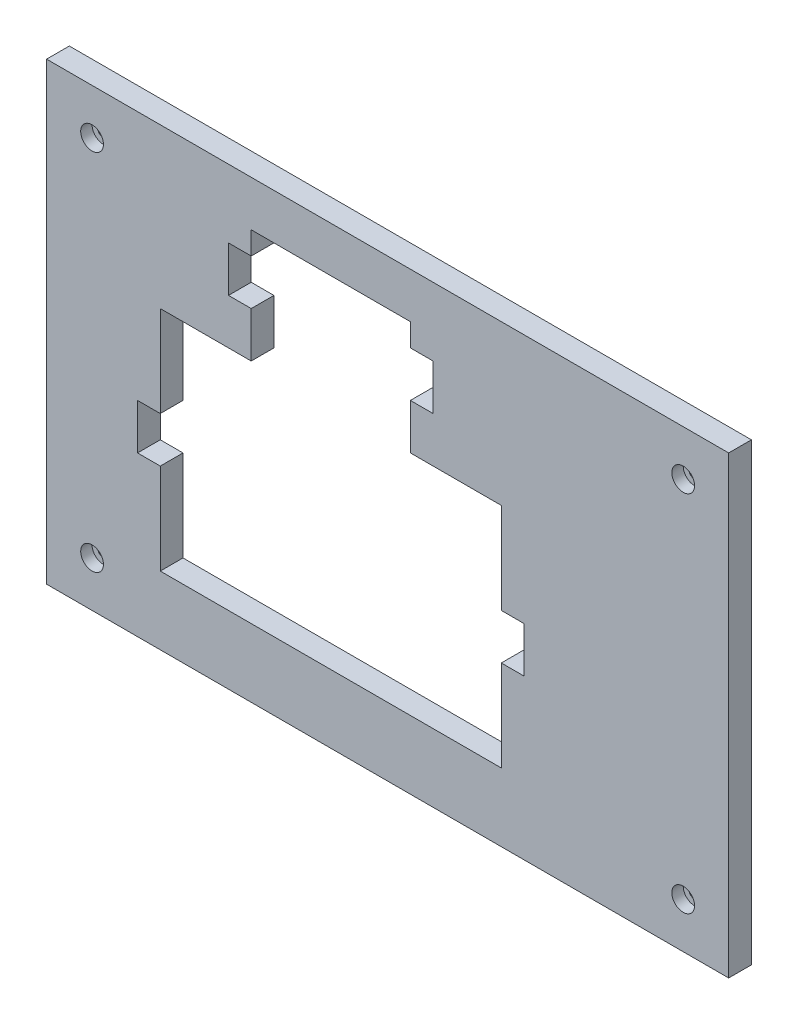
ISO-10303-21;
HEADER;
FILE_DESCRIPTION(('STEP AP214'),'2;1');
FILE_NAME('part.step','',(''),(''),'','','');
FILE_SCHEMA(('AUTOMOTIVE_DESIGN { 1 0 10303 214 1 1 1 1 }'));
ENDSEC;
DATA;
#1=APPLICATION_CONTEXT('core data for automotive mechanical design processes');
#2=APPLICATION_PROTOCOL_DEFINITION('international standard','automotive_design',2000,#1);
#3=PRODUCT_CONTEXT('',#1,'mechanical');
#4=PRODUCT('Part','Part','',(#3));
#5=PRODUCT_RELATED_PRODUCT_CATEGORY('part','',(#4));
#6=PRODUCT_DEFINITION_FORMATION('','',#4);
#7=PRODUCT_DEFINITION_CONTEXT('part definition',#1,'design');
#8=PRODUCT_DEFINITION('design','',#6,#7);
#9=PRODUCT_DEFINITION_SHAPE('','',#8);
#10=(LENGTH_UNIT() NAMED_UNIT(*) SI_UNIT(.MILLI.,.METRE.));
#11=(NAMED_UNIT(*) PLANE_ANGLE_UNIT() SI_UNIT($,.RADIAN.));
#12=(NAMED_UNIT(*) SI_UNIT($,.STERADIAN.) SOLID_ANGLE_UNIT());
#13=UNCERTAINTY_MEASURE_WITH_UNIT(LENGTH_MEASURE(1.E-05),#10,'distance_accuracy_value','');
#14=(GEOMETRIC_REPRESENTATION_CONTEXT(3) GLOBAL_UNCERTAINTY_ASSIGNED_CONTEXT((#13)) GLOBAL_UNIT_ASSIGNED_CONTEXT((#10,
#11,#12)) REPRESENTATION_CONTEXT('',''));
#15=CARTESIAN_POINT('',(0.,0.,0.));
#16=DIRECTION('',(0.,0.,1.));
#17=DIRECTION('',(1.,0.,0.));
#18=AXIS2_PLACEMENT_3D('',#15,#16,#17);
#19=CARTESIAN_POINT('',(0.,0.,-10.));
#20=DIRECTION('',(-1.,0.,0.));
#21=DIRECTION('',(0.,0.,1.));
#22=AXIS2_PLACEMENT_3D('',#19,#20,#21);
#23=PLANE('',#22);
#24=DIRECTION('',(0.,-1.,0.));
#25=VECTOR('',#24,1.);
#26=CARTESIAN_POINT('',(0.,0.,0.));
#27=LINE('',#26,#25);
#28=CARTESIAN_POINT('',(0.,200.,0.));
#29=VERTEX_POINT('',#28);
#30=CARTESIAN_POINT('',(0.,0.,0.));
#31=VERTEX_POINT('',#30);
#32=EDGE_CURVE('E366',#29,#31,#27,.T.);
#33=ORIENTED_EDGE('',*,*,#32,.F.);
#34=DIRECTION('',(0.,0.,1.));
#35=VECTOR('',#34,1.);
#36=CARTESIAN_POINT('',(0.,200.,-10.));
#37=LINE('',#36,#35);
#38=CARTESIAN_POINT('',(0.,200.,-10.));
#39=VERTEX_POINT('',#38);
#40=EDGE_CURVE('E11',#39,#29,#37,.T.);
#41=ORIENTED_EDGE('',*,*,#40,.F.);
#42=DIRECTION('',(0.,-1.,0.));
#43=VECTOR('',#42,1.);
#44=CARTESIAN_POINT('',(0.,0.,-10.));
#45=LINE('',#44,#43);
#46=CARTESIAN_POINT('',(0.,0.,-10.));
#47=VERTEX_POINT('',#46);
#48=EDGE_CURVE('E420',#39,#47,#45,.T.);
#49=ORIENTED_EDGE('',*,*,#48,.T.);
#50=DIRECTION('',(0.,0.,1.));
#51=VECTOR('',#50,1.);
#52=CARTESIAN_POINT('',(0.,0.,-10.));
#53=LINE('',#52,#51);
#54=EDGE_CURVE('E29',#47,#31,#53,.T.);
#55=ORIENTED_EDGE('',*,*,#54,.T.);
#56=EDGE_LOOP('',(#33,#41,#49,#55));
#57=FACE_BOUND('',#56,.T.);
#58=ADVANCED_FACE('F26',(#57),#23,.T.);
#59=CARTESIAN_POINT('',(0.,200.,-10.));
#60=DIRECTION('',(0.,1.,0.));
#61=DIRECTION('',(0.,0.,1.));
#62=AXIS2_PLACEMENT_3D('',#59,#60,#61);
#63=PLANE('',#62);
#64=DIRECTION('',(-1.,0.,0.));
#65=VECTOR('',#64,1.);
#66=CARTESIAN_POINT('',(0.,200.,0.));
#67=LINE('',#66,#65);
#68=CARTESIAN_POINT('',(300.,200.,0.));
#69=VERTEX_POINT('',#68);
#70=EDGE_CURVE('E417',#69,#29,#67,.T.);
#71=ORIENTED_EDGE('',*,*,#70,.F.);
#72=DIRECTION('',(0.,0.,1.));
#73=VECTOR('',#72,1.);
#74=CARTESIAN_POINT('',(300.,200.,-10.));
#75=LINE('',#74,#73);
#76=CARTESIAN_POINT('',(300.,200.,-10.));
#77=VERTEX_POINT('',#76);
#78=EDGE_CURVE('E34',#77,#69,#75,.T.);
#79=ORIENTED_EDGE('',*,*,#78,.F.);
#80=DIRECTION('',(-1.,0.,0.));
#81=VECTOR('',#80,1.);
#82=CARTESIAN_POINT('',(0.,200.,-10.));
#83=LINE('',#82,#81);
#84=EDGE_CURVE('E429',#77,#39,#83,.T.);
#85=ORIENTED_EDGE('',*,*,#84,.T.);
#86=ORIENTED_EDGE('',*,*,#40,.T.);
#87=EDGE_LOOP('',(#71,#79,#85,#86));
#88=FACE_BOUND('',#87,.T.);
#89=ADVANCED_FACE('F443',(#88),#63,.T.);
#90=CARTESIAN_POINT('',(300.,0.,-10.));
#91=DIRECTION('',(1.,0.,0.));
#92=DIRECTION('',(0.,0.,-1.));
#93=AXIS2_PLACEMENT_3D('',#90,#91,#92);
#94=PLANE('',#93);
#95=DIRECTION('',(0.,1.,0.));
#96=VECTOR('',#95,1.);
#97=CARTESIAN_POINT('',(300.,0.,0.));
#98=LINE('',#97,#96);
#99=CARTESIAN_POINT('',(300.,0.,0.));
#100=VERTEX_POINT('',#99);
#101=EDGE_CURVE('E414',#100,#69,#98,.T.);
#102=ORIENTED_EDGE('',*,*,#101,.F.);
#103=DIRECTION('',(0.,0.,1.));
#104=VECTOR('',#103,1.);
#105=CARTESIAN_POINT('',(300.,0.,-10.));
#106=LINE('',#105,#104);
#107=CARTESIAN_POINT('',(300.,0.,-10.));
#108=VERTEX_POINT('',#107);
#109=EDGE_CURVE('E432',#108,#100,#106,.T.);
#110=ORIENTED_EDGE('',*,*,#109,.F.);
#111=DIRECTION('',(0.,1.,0.));
#112=VECTOR('',#111,1.);
#113=CARTESIAN_POINT('',(300.,0.,-10.));
#114=LINE('',#113,#112);
#115=EDGE_CURVE('E426',#108,#77,#114,.T.);
#116=ORIENTED_EDGE('',*,*,#115,.T.);
#117=ORIENTED_EDGE('',*,*,#78,.T.);
#118=EDGE_LOOP('',(#102,#110,#116,#117));
#119=FACE_BOUND('',#118,.T.);
#120=ADVANCED_FACE('F449',(#119),#94,.T.);
#121=CARTESIAN_POINT('',(0.,0.,-10.));
#122=DIRECTION('',(0.,-1.,0.));
#123=DIRECTION('',(0.,0.,-1.));
#124=AXIS2_PLACEMENT_3D('',#121,#122,#123);
#125=PLANE('',#124);
#126=DIRECTION('',(1.,0.,0.));
#127=VECTOR('',#126,1.);
#128=CARTESIAN_POINT('',(0.,0.,0.));
#129=LINE('',#128,#127);
#130=EDGE_CURVE('E411',#31,#100,#129,.T.);
#131=ORIENTED_EDGE('',*,*,#130,.F.);
#132=ORIENTED_EDGE('',*,*,#54,.F.);
#133=DIRECTION('',(1.,0.,0.));
#134=VECTOR('',#133,1.);
#135=CARTESIAN_POINT('',(0.,0.,-10.));
#136=LINE('',#135,#134);
#137=EDGE_CURVE('E423',#47,#108,#136,.T.);
#138=ORIENTED_EDGE('',*,*,#137,.T.);
#139=ORIENTED_EDGE('',*,*,#109,.T.);
#140=EDGE_LOOP('',(#131,#132,#138,#139));
#141=FACE_BOUND('',#140,.T.);
#142=ADVANCED_FACE('F440',(#141),#125,.T.);
#143=CARTESIAN_POINT('',(0.,200.,-10.));
#144=DIRECTION('',(0.,0.,-1.));
#145=DIRECTION('',(-1.,0.,0.));
#146=AXIS2_PLACEMENT_3D('',#143,#144,#145);
#147=PLANE('',#146);
#148=CARTESIAN_POINT('',(280.,20.,-10.));
#149=DIRECTION('',(0.,0.,1.));
#150=DIRECTION('',(1.,0.,0.));
#151=AXIS2_PLACEMENT_3D('',#148,#149,#150);
#152=CIRCLE('',#151,2.5);
#153=CARTESIAN_POINT('',(282.5,20.,-10.));
#154=VERTEX_POINT('',#153);
#155=EDGE_CURVE('E772',#154,#154,#152,.T.);
#156=ORIENTED_EDGE('',*,*,#155,.T.);
#157=EDGE_LOOP('',(#156));
#158=FACE_BOUND('',#157,.T.);
#159=CARTESIAN_POINT('',(280.,180.,-10.));
#160=DIRECTION('',(0.,0.,1.));
#161=DIRECTION('',(1.,0.,0.));
#162=AXIS2_PLACEMENT_3D('',#159,#160,#161);
#163=CIRCLE('',#162,2.5);
#164=CARTESIAN_POINT('',(282.5,180.,-10.));
#165=VERTEX_POINT('',#164);
#166=EDGE_CURVE('E782',#165,#165,#163,.T.);
#167=ORIENTED_EDGE('',*,*,#166,.T.);
#168=EDGE_LOOP('',(#167));
#169=FACE_BOUND('',#168,.T.);
#170=CARTESIAN_POINT('',(20.,20.,-10.));
#171=DIRECTION('',(0.,0.,1.));
#172=DIRECTION('',(1.,0.,0.));
#173=AXIS2_PLACEMENT_3D('',#170,#171,#172);
#174=CIRCLE('',#173,2.5);
#175=CARTESIAN_POINT('',(22.5,20.,-10.));
#176=VERTEX_POINT('',#175);
#177=EDGE_CURVE('E788',#176,#176,#174,.T.);
#178=ORIENTED_EDGE('',*,*,#177,.T.);
#179=EDGE_LOOP('',(#178));
#180=FACE_BOUND('',#179,.T.);
#181=CARTESIAN_POINT('',(20.,180.,-10.));
#182=DIRECTION('',(0.,0.,1.));
#183=DIRECTION('',(1.,0.,0.));
#184=AXIS2_PLACEMENT_3D('',#181,#182,#183);
#185=CIRCLE('',#184,2.5);
#186=CARTESIAN_POINT('',(22.5,180.,-10.));
#187=VERTEX_POINT('',#186);
#188=EDGE_CURVE('E812',#187,#187,#185,.T.);
#189=ORIENTED_EDGE('',*,*,#188,.T.);
#190=EDGE_LOOP('',(#189));
#191=FACE_BOUND('',#190,.T.);
#192=DIRECTION('',(0.,1.,0.));
#193=VECTOR('',#192,1.);
#194=CARTESIAN_POINT('',(200.,30.,-10.));
#195=LINE('',#194,#193);
#196=CARTESIAN_POINT('',(200.,30.,-10.));
#197=VERTEX_POINT('',#196);
#198=CARTESIAN_POINT('',(200.,70.,-10.));
#199=VERTEX_POINT('',#198);
#200=EDGE_CURVE('E295',#197,#199,#195,.T.);
#201=ORIENTED_EDGE('',*,*,#200,.T.);
#202=DIRECTION('',(1.,0.,0.));
#203=VECTOR('',#202,1.);
#204=CARTESIAN_POINT('',(200.,70.,-10.));
#205=LINE('',#204,#203);
#206=CARTESIAN_POINT('',(210.,70.,-10.));
#207=VERTEX_POINT('',#206);
#208=EDGE_CURVE('E298',#199,#207,#205,.T.);
#209=ORIENTED_EDGE('',*,*,#208,.T.);
#210=DIRECTION('',(0.,1.,0.));
#211=VECTOR('',#210,1.);
#212=CARTESIAN_POINT('',(210.,70.,-10.));
#213=LINE('',#212,#211);
#214=CARTESIAN_POINT('',(210.,90.,-10.));
#215=VERTEX_POINT('',#214);
#216=EDGE_CURVE('E42',#207,#215,#213,.T.);
#217=ORIENTED_EDGE('',*,*,#216,.T.);
#218=DIRECTION('',(-1.,0.,0.));
#219=VECTOR('',#218,1.);
#220=CARTESIAN_POINT('',(210.,90.,-10.));
#221=LINE('',#220,#219);
#222=CARTESIAN_POINT('',(200.,90.,-10.));
#223=VERTEX_POINT('',#222);
#224=EDGE_CURVE('E301',#215,#223,#221,.T.);
#225=ORIENTED_EDGE('',*,*,#224,.T.);
#226=DIRECTION('',(0.,1.,0.));
#227=VECTOR('',#226,1.);
#228=CARTESIAN_POINT('',(200.,90.,-10.));
#229=LINE('',#228,#227);
#230=CARTESIAN_POINT('',(200.,130.,-10.));
#231=VERTEX_POINT('',#230);
#232=EDGE_CURVE('E304',#223,#231,#229,.T.);
#233=ORIENTED_EDGE('',*,*,#232,.T.);
#234=DIRECTION('',(-1.,0.,0.));
#235=VECTOR('',#234,1.);
#236=CARTESIAN_POINT('',(200.,130.,-10.));
#237=LINE('',#236,#235);
#238=CARTESIAN_POINT('',(160.,130.,-10.));
#239=VERTEX_POINT('',#238);
#240=EDGE_CURVE('E307',#231,#239,#237,.T.);
#241=ORIENTED_EDGE('',*,*,#240,.T.);
#242=DIRECTION('',(0.,1.,0.));
#243=VECTOR('',#242,1.);
#244=CARTESIAN_POINT('',(160.,130.,-10.));
#245=LINE('',#244,#243);
#246=CARTESIAN_POINT('',(160.,150.,-10.));
#247=VERTEX_POINT('',#246);
#248=EDGE_CURVE('E310',#239,#247,#245,.T.);
#249=ORIENTED_EDGE('',*,*,#248,.T.);
#250=DIRECTION('',(1.,0.,0.));
#251=VECTOR('',#250,1.);
#252=CARTESIAN_POINT('',(160.,150.,-10.));
#253=LINE('',#252,#251);
#254=CARTESIAN_POINT('',(170.,150.,-10.));
#255=VERTEX_POINT('',#254);
#256=EDGE_CURVE('E313',#247,#255,#253,.T.);
#257=ORIENTED_EDGE('',*,*,#256,.T.);
#258=DIRECTION('',(0.,1.,0.));
#259=VECTOR('',#258,1.);
#260=CARTESIAN_POINT('',(170.,150.,-10.));
#261=LINE('',#260,#259);
#262=CARTESIAN_POINT('',(170.,170.,-10.));
#263=VERTEX_POINT('',#262);
#264=EDGE_CURVE('E316',#255,#263,#261,.T.);
#265=ORIENTED_EDGE('',*,*,#264,.T.);
#266=DIRECTION('',(-1.,0.,0.));
#267=VECTOR('',#266,1.);
#268=CARTESIAN_POINT('',(170.,170.,-10.));
#269=LINE('',#268,#267);
#270=CARTESIAN_POINT('',(160.,170.,-10.));
#271=VERTEX_POINT('',#270);
#272=EDGE_CURVE('E319',#263,#271,#269,.T.);
#273=ORIENTED_EDGE('',*,*,#272,.T.);
#274=DIRECTION('',(0.,1.,0.));
#275=VECTOR('',#274,1.);
#276=CARTESIAN_POINT('',(160.,170.,-10.));
#277=LINE('',#276,#275);
#278=CARTESIAN_POINT('',(160.,180.,-10.));
#279=VERTEX_POINT('',#278);
#280=EDGE_CURVE('E322',#271,#279,#277,.T.);
#281=ORIENTED_EDGE('',*,*,#280,.T.);
#282=DIRECTION('',(-1.,0.,0.));
#283=VECTOR('',#282,1.);
#284=CARTESIAN_POINT('',(160.,180.,-10.));
#285=LINE('',#284,#283);
#286=CARTESIAN_POINT('',(90.,180.,-10.));
#287=VERTEX_POINT('',#286);
#288=EDGE_CURVE('E325',#279,#287,#285,.T.);
#289=ORIENTED_EDGE('',*,*,#288,.T.);
#290=DIRECTION('',(0.,-1.,0.));
#291=VECTOR('',#290,1.);
#292=CARTESIAN_POINT('',(90.,170.,-10.));
#293=LINE('',#292,#291);
#294=CARTESIAN_POINT('',(90.,170.,-10.));
#295=VERTEX_POINT('',#294);
#296=EDGE_CURVE('E328',#287,#295,#293,.T.);
#297=ORIENTED_EDGE('',*,*,#296,.T.);
#298=DIRECTION('',(-1.,0.,0.));
#299=VECTOR('',#298,1.);
#300=CARTESIAN_POINT('',(80.,170.,-10.));
#301=LINE('',#300,#299);
#302=CARTESIAN_POINT('',(80.,170.,-10.));
#303=VERTEX_POINT('',#302);
#304=EDGE_CURVE('E331',#295,#303,#301,.T.);
#305=ORIENTED_EDGE('',*,*,#304,.T.);
#306=DIRECTION('',(0.,-1.,0.));
#307=VECTOR('',#306,1.);
#308=CARTESIAN_POINT('',(80.,150.,-10.));
#309=LINE('',#308,#307);
#310=CARTESIAN_POINT('',(80.,150.,-10.));
#311=VERTEX_POINT('',#310);
#312=EDGE_CURVE('E334',#303,#311,#309,.T.);
#313=ORIENTED_EDGE('',*,*,#312,.T.);
#314=DIRECTION('',(1.,0.,0.));
#315=VECTOR('',#314,1.);
#316=CARTESIAN_POINT('',(90.,150.,-10.));
#317=LINE('',#316,#315);
#318=CARTESIAN_POINT('',(90.,150.,-10.));
#319=VERTEX_POINT('',#318);
#320=EDGE_CURVE('E337',#311,#319,#317,.T.);
#321=ORIENTED_EDGE('',*,*,#320,.T.);
#322=DIRECTION('',(0.,-1.,0.));
#323=VECTOR('',#322,1.);
#324=CARTESIAN_POINT('',(90.,130.,-10.));
#325=LINE('',#324,#323);
#326=CARTESIAN_POINT('',(90.,130.,-10.));
#327=VERTEX_POINT('',#326);
#328=EDGE_CURVE('E340',#319,#327,#325,.T.);
#329=ORIENTED_EDGE('',*,*,#328,.T.);
#330=DIRECTION('',(-1.,0.,0.));
#331=VECTOR('',#330,1.);
#332=CARTESIAN_POINT('',(50.,130.,-10.));
#333=LINE('',#332,#331);
#334=CARTESIAN_POINT('',(50.,130.,-10.));
#335=VERTEX_POINT('',#334);
#336=EDGE_CURVE('E343',#327,#335,#333,.T.);
#337=ORIENTED_EDGE('',*,*,#336,.T.);
#338=DIRECTION('',(0.,-1.,0.));
#339=VECTOR('',#338,1.);
#340=CARTESIAN_POINT('',(50.,90.,-10.));
#341=LINE('',#340,#339);
#342=CARTESIAN_POINT('',(50.,90.,-10.));
#343=VERTEX_POINT('',#342);
#344=EDGE_CURVE('E346',#335,#343,#341,.T.);
#345=ORIENTED_EDGE('',*,*,#344,.T.);
#346=DIRECTION('',(-1.,0.,0.));
#347=VECTOR('',#346,1.);
#348=CARTESIAN_POINT('',(40.,90.,-10.));
#349=LINE('',#348,#347);
#350=CARTESIAN_POINT('',(40.,90.,-10.));
#351=VERTEX_POINT('',#350);
#352=EDGE_CURVE('E349',#343,#351,#349,.T.);
#353=ORIENTED_EDGE('',*,*,#352,.T.);
#354=DIRECTION('',(0.,-1.,0.));
#355=VECTOR('',#354,1.);
#356=CARTESIAN_POINT('',(40.,70.,-10.));
#357=LINE('',#356,#355);
#358=CARTESIAN_POINT('',(40.,70.,-10.));
#359=VERTEX_POINT('',#358);
#360=EDGE_CURVE('E352',#351,#359,#357,.T.);
#361=ORIENTED_EDGE('',*,*,#360,.T.);
#362=DIRECTION('',(1.,0.,0.));
#363=VECTOR('',#362,1.);
#364=CARTESIAN_POINT('',(50.,70.,-10.));
#365=LINE('',#364,#363);
#366=CARTESIAN_POINT('',(50.,70.,-10.));
#367=VERTEX_POINT('',#366);
#368=EDGE_CURVE('E355',#359,#367,#365,.T.);
#369=ORIENTED_EDGE('',*,*,#368,.T.);
#370=DIRECTION('',(0.,-1.,0.));
#371=VECTOR('',#370,1.);
#372=CARTESIAN_POINT('',(50.,30.,-10.));
#373=LINE('',#372,#371);
#374=CARTESIAN_POINT('',(50.,30.,-10.));
#375=VERTEX_POINT('',#374);
#376=EDGE_CURVE('E358',#367,#375,#373,.T.);
#377=ORIENTED_EDGE('',*,*,#376,.T.);
#378=DIRECTION('',(1.,0.,0.));
#379=VECTOR('',#378,1.);
#380=CARTESIAN_POINT('',(50.,30.,-10.));
#381=LINE('',#380,#379);
#382=EDGE_CURVE('E361',#375,#197,#381,.T.);
#383=ORIENTED_EDGE('',*,*,#382,.T.);
#384=EDGE_LOOP('',(#201,#209,#217,#225,#233,#241,#249,#257,#265,#273,#281,#289,#297,#305,#313,
#321,#329,#337,#345,#353,#361,#369,#377,#383));
#385=FACE_BOUND('',#384,.T.);
#386=ORIENTED_EDGE('',*,*,#48,.F.);
#387=ORIENTED_EDGE('',*,*,#84,.F.);
#388=ORIENTED_EDGE('',*,*,#115,.F.);
#389=ORIENTED_EDGE('',*,*,#137,.F.);
#390=EDGE_LOOP('',(#386,#387,#388,#389));
#391=FACE_BOUND('',#390,.T.);
#392=ADVANCED_FACE('F446',(#158,#169,#180,#191,#385,#391),#147,.T.);
#393=CARTESIAN_POINT('',(0.,200.,0.));
#394=DIRECTION('',(0.,0.,-1.));
#395=DIRECTION('',(-1.,0.,0.));
#396=AXIS2_PLACEMENT_3D('',#393,#394,#395);
#397=PLANE('',#396);
#398=CARTESIAN_POINT('',(280.,20.,0.));
#399=DIRECTION('',(0.,0.,1.));
#400=DIRECTION('',(1.,0.,0.));
#401=AXIS2_PLACEMENT_3D('',#398,#399,#400);
#402=CIRCLE('',#401,5.);
#403=CARTESIAN_POINT('',(285.,20.,0.));
#404=VERTEX_POINT('',#403);
#405=EDGE_CURVE('E791',#404,#404,#402,.T.);
#406=ORIENTED_EDGE('',*,*,#405,.F.);
#407=EDGE_LOOP('',(#406));
#408=FACE_BOUND('',#407,.T.);
#409=CARTESIAN_POINT('',(280.,180.,0.));
#410=DIRECTION('',(0.,0.,1.));
#411=DIRECTION('',(1.,0.,0.));
#412=AXIS2_PLACEMENT_3D('',#409,#410,#411);
#413=CIRCLE('',#412,5.);
#414=CARTESIAN_POINT('',(285.,180.,0.));
#415=VERTEX_POINT('',#414);
#416=EDGE_CURVE('E797',#415,#415,#413,.T.);
#417=ORIENTED_EDGE('',*,*,#416,.F.);
#418=EDGE_LOOP('',(#417));
#419=FACE_BOUND('',#418,.T.);
#420=CARTESIAN_POINT('',(20.,20.,0.));
#421=DIRECTION('',(0.,0.,1.));
#422=DIRECTION('',(1.,0.,0.));
#423=AXIS2_PLACEMENT_3D('',#420,#421,#422);
#424=CIRCLE('',#423,5.);
#425=CARTESIAN_POINT('',(25.,20.,0.));
#426=VERTEX_POINT('',#425);
#427=EDGE_CURVE('E803',#426,#426,#424,.T.);
#428=ORIENTED_EDGE('',*,*,#427,.F.);
#429=EDGE_LOOP('',(#428));
#430=FACE_BOUND('',#429,.T.);
#431=CARTESIAN_POINT('',(20.,180.,0.));
#432=DIRECTION('',(0.,0.,1.));
#433=DIRECTION('',(1.,0.,0.));
#434=AXIS2_PLACEMENT_3D('',#431,#432,#433);
#435=CIRCLE('',#434,5.);
#436=CARTESIAN_POINT('',(25.,180.,0.));
#437=VERTEX_POINT('',#436);
#438=EDGE_CURVE('E815',#437,#437,#435,.T.);
#439=ORIENTED_EDGE('',*,*,#438,.F.);
#440=EDGE_LOOP('',(#439));
#441=FACE_BOUND('',#440,.T.);
#442=DIRECTION('',(1.,0.,0.));
#443=VECTOR('',#442,1.);
#444=CARTESIAN_POINT('',(200.,70.,0.));
#445=LINE('',#444,#443);
#446=CARTESIAN_POINT('',(200.,70.,0.));
#447=VERTEX_POINT('',#446);
#448=CARTESIAN_POINT('',(210.,70.,0.));
#449=VERTEX_POINT('',#448);
#450=EDGE_CURVE('E222',#447,#449,#445,.T.);
#451=ORIENTED_EDGE('',*,*,#450,.F.);
#452=DIRECTION('',(0.,1.,0.));
#453=VECTOR('',#452,1.);
#454=CARTESIAN_POINT('',(200.,30.,0.));
#455=LINE('',#454,#453);
#456=CARTESIAN_POINT('',(200.,30.,0.));
#457=VERTEX_POINT('',#456);
#458=EDGE_CURVE('E50',#457,#447,#455,.T.);
#459=ORIENTED_EDGE('',*,*,#458,.F.);
#460=DIRECTION('',(1.,0.,0.));
#461=VECTOR('',#460,1.);
#462=CARTESIAN_POINT('',(50.,30.,0.));
#463=LINE('',#462,#461);
#464=CARTESIAN_POINT('',(50.,30.,0.));
#465=VERTEX_POINT('',#464);
#466=EDGE_CURVE('E292',#465,#457,#463,.T.);
#467=ORIENTED_EDGE('',*,*,#466,.F.);
#468=DIRECTION('',(0.,-1.,0.));
#469=VECTOR('',#468,1.);
#470=CARTESIAN_POINT('',(50.,30.,0.));
#471=LINE('',#470,#469);
#472=CARTESIAN_POINT('',(50.,70.,0.));
#473=VERTEX_POINT('',#472);
#474=EDGE_CURVE('E289',#473,#465,#471,.T.);
#475=ORIENTED_EDGE('',*,*,#474,.F.);
#476=DIRECTION('',(1.,0.,0.));
#477=VECTOR('',#476,1.);
#478=CARTESIAN_POINT('',(50.,70.,0.));
#479=LINE('',#478,#477);
#480=CARTESIAN_POINT('',(40.,70.,0.));
#481=VERTEX_POINT('',#480);
#482=EDGE_CURVE('E286',#481,#473,#479,.T.);
#483=ORIENTED_EDGE('',*,*,#482,.F.);
#484=DIRECTION('',(0.,-1.,0.));
#485=VECTOR('',#484,1.);
#486=CARTESIAN_POINT('',(40.,70.,0.));
#487=LINE('',#486,#485);
#488=CARTESIAN_POINT('',(40.,90.,0.));
#489=VERTEX_POINT('',#488);
#490=EDGE_CURVE('E283',#489,#481,#487,.T.);
#491=ORIENTED_EDGE('',*,*,#490,.F.);
#492=DIRECTION('',(-1.,0.,0.));
#493=VECTOR('',#492,1.);
#494=CARTESIAN_POINT('',(40.,90.,0.));
#495=LINE('',#494,#493);
#496=CARTESIAN_POINT('',(50.,90.,0.));
#497=VERTEX_POINT('',#496);
#498=EDGE_CURVE('E280',#497,#489,#495,.T.);
#499=ORIENTED_EDGE('',*,*,#498,.F.);
#500=DIRECTION('',(0.,-1.,0.));
#501=VECTOR('',#500,1.);
#502=CARTESIAN_POINT('',(50.,90.,0.));
#503=LINE('',#502,#501);
#504=CARTESIAN_POINT('',(50.,130.,0.));
#505=VERTEX_POINT('',#504);
#506=EDGE_CURVE('E277',#505,#497,#503,.T.);
#507=ORIENTED_EDGE('',*,*,#506,.F.);
#508=DIRECTION('',(-1.,0.,0.));
#509=VECTOR('',#508,1.);
#510=CARTESIAN_POINT('',(50.,130.,0.));
#511=LINE('',#510,#509);
#512=CARTESIAN_POINT('',(90.,130.,0.));
#513=VERTEX_POINT('',#512);
#514=EDGE_CURVE('E274',#513,#505,#511,.T.);
#515=ORIENTED_EDGE('',*,*,#514,.F.);
#516=DIRECTION('',(0.,-1.,0.));
#517=VECTOR('',#516,1.);
#518=CARTESIAN_POINT('',(90.,130.,0.));
#519=LINE('',#518,#517);
#520=CARTESIAN_POINT('',(90.,150.,0.));
#521=VERTEX_POINT('',#520);
#522=EDGE_CURVE('E271',#521,#513,#519,.T.);
#523=ORIENTED_EDGE('',*,*,#522,.F.);
#524=DIRECTION('',(1.,0.,0.));
#525=VECTOR('',#524,1.);
#526=CARTESIAN_POINT('',(90.,150.,0.));
#527=LINE('',#526,#525);
#528=CARTESIAN_POINT('',(80.,150.,0.));
#529=VERTEX_POINT('',#528);
#530=EDGE_CURVE('E268',#529,#521,#527,.T.);
#531=ORIENTED_EDGE('',*,*,#530,.F.);
#532=DIRECTION('',(0.,-1.,0.));
#533=VECTOR('',#532,1.);
#534=CARTESIAN_POINT('',(80.,150.,0.));
#535=LINE('',#534,#533);
#536=CARTESIAN_POINT('',(80.,170.,0.));
#537=VERTEX_POINT('',#536);
#538=EDGE_CURVE('E265',#537,#529,#535,.T.);
#539=ORIENTED_EDGE('',*,*,#538,.F.);
#540=DIRECTION('',(-1.,0.,0.));
#541=VECTOR('',#540,1.);
#542=CARTESIAN_POINT('',(80.,170.,0.));
#543=LINE('',#542,#541);
#544=CARTESIAN_POINT('',(90.,170.,0.));
#545=VERTEX_POINT('',#544);
#546=EDGE_CURVE('E262',#545,#537,#543,.T.);
#547=ORIENTED_EDGE('',*,*,#546,.F.);
#548=DIRECTION('',(0.,-1.,0.));
#549=VECTOR('',#548,1.);
#550=CARTESIAN_POINT('',(90.,170.,0.));
#551=LINE('',#550,#549);
#552=CARTESIAN_POINT('',(90.,180.,0.));
#553=VERTEX_POINT('',#552);
#554=EDGE_CURVE('E259',#553,#545,#551,.T.);
#555=ORIENTED_EDGE('',*,*,#554,.F.);
#556=DIRECTION('',(-1.,0.,0.));
#557=VECTOR('',#556,1.);
#558=CARTESIAN_POINT('',(160.,180.,0.));
#559=LINE('',#558,#557);
#560=CARTESIAN_POINT('',(160.,180.,0.));
#561=VERTEX_POINT('',#560);
#562=EDGE_CURVE('E256',#561,#553,#559,.T.);
#563=ORIENTED_EDGE('',*,*,#562,.F.);
#564=DIRECTION('',(0.,1.,0.));
#565=VECTOR('',#564,1.);
#566=CARTESIAN_POINT('',(160.,170.,0.));
#567=LINE('',#566,#565);
#568=CARTESIAN_POINT('',(160.,170.,0.));
#569=VERTEX_POINT('',#568);
#570=EDGE_CURVE('E253',#569,#561,#567,.T.);
#571=ORIENTED_EDGE('',*,*,#570,.F.);
#572=DIRECTION('',(-1.,0.,0.));
#573=VECTOR('',#572,1.);
#574=CARTESIAN_POINT('',(170.,170.,0.));
#575=LINE('',#574,#573);
#576=CARTESIAN_POINT('',(170.,170.,0.));
#577=VERTEX_POINT('',#576);
#578=EDGE_CURVE('E250',#577,#569,#575,.T.);
#579=ORIENTED_EDGE('',*,*,#578,.F.);
#580=DIRECTION('',(0.,1.,0.));
#581=VECTOR('',#580,1.);
#582=CARTESIAN_POINT('',(170.,150.,0.));
#583=LINE('',#582,#581);
#584=CARTESIAN_POINT('',(170.,150.,0.));
#585=VERTEX_POINT('',#584);
#586=EDGE_CURVE('E247',#585,#577,#583,.T.);
#587=ORIENTED_EDGE('',*,*,#586,.F.);
#588=DIRECTION('',(1.,0.,0.));
#589=VECTOR('',#588,1.);
#590=CARTESIAN_POINT('',(160.,150.,0.));
#591=LINE('',#590,#589);
#592=CARTESIAN_POINT('',(160.,150.,0.));
#593=VERTEX_POINT('',#592);
#594=EDGE_CURVE('E244',#593,#585,#591,.T.);
#595=ORIENTED_EDGE('',*,*,#594,.F.);
#596=DIRECTION('',(0.,1.,0.));
#597=VECTOR('',#596,1.);
#598=CARTESIAN_POINT('',(160.,130.,0.));
#599=LINE('',#598,#597);
#600=CARTESIAN_POINT('',(160.,130.,0.));
#601=VERTEX_POINT('',#600);
#602=EDGE_CURVE('E241',#601,#593,#599,.T.);
#603=ORIENTED_EDGE('',*,*,#602,.F.);
#604=DIRECTION('',(-1.,0.,0.));
#605=VECTOR('',#604,1.);
#606=CARTESIAN_POINT('',(200.,130.,0.));
#607=LINE('',#606,#605);
#608=CARTESIAN_POINT('',(200.,130.,0.));
#609=VERTEX_POINT('',#608);
#610=EDGE_CURVE('E238',#609,#601,#607,.T.);
#611=ORIENTED_EDGE('',*,*,#610,.F.);
#612=DIRECTION('',(0.,1.,0.));
#613=VECTOR('',#612,1.);
#614=CARTESIAN_POINT('',(200.,90.,0.));
#615=LINE('',#614,#613);
#616=CARTESIAN_POINT('',(200.,90.,0.));
#617=VERTEX_POINT('',#616);
#618=EDGE_CURVE('E232',#617,#609,#615,.T.);
#619=ORIENTED_EDGE('',*,*,#618,.F.);
#620=DIRECTION('',(-1.,0.,0.));
#621=VECTOR('',#620,1.);
#622=CARTESIAN_POINT('',(210.,90.,0.));
#623=LINE('',#622,#621);
#624=CARTESIAN_POINT('',(210.,90.,0.));
#625=VERTEX_POINT('',#624);
#626=EDGE_CURVE('E230',#625,#617,#623,.T.);
#627=ORIENTED_EDGE('',*,*,#626,.F.);
#628=DIRECTION('',(0.,1.,0.));
#629=VECTOR('',#628,1.);
#630=CARTESIAN_POINT('',(210.,70.,0.));
#631=LINE('',#630,#629);
#632=EDGE_CURVE('E213',#449,#625,#631,.T.);
#633=ORIENTED_EDGE('',*,*,#632,.F.);
#634=EDGE_LOOP('',(#451,#459,#467,#475,#483,#491,#499,#507,#515,#523,#531,#539,#547,#555,#563,
#571,#579,#587,#595,#603,#611,#619,#627,#633));
#635=FACE_BOUND('',#634,.T.);
#636=ORIENTED_EDGE('',*,*,#32,.T.);
#637=ORIENTED_EDGE('',*,*,#130,.T.);
#638=ORIENTED_EDGE('',*,*,#101,.T.);
#639=ORIENTED_EDGE('',*,*,#70,.T.);
#640=EDGE_LOOP('',(#636,#637,#638,#639));
#641=FACE_BOUND('',#640,.T.);
#642=ADVANCED_FACE('F226',(#408,#419,#430,#441,#635,#641),#397,.F.);
#643=CARTESIAN_POINT('',(200.,30.,-10.));
#644=DIRECTION('',(1.,0.,0.));
#645=DIRECTION('',(0.,0.,-1.));
#646=AXIS2_PLACEMENT_3D('',#643,#644,#645);
#647=PLANE('',#646);
#648=ORIENTED_EDGE('',*,*,#458,.T.);
#649=DIRECTION('',(0.,0.,1.));
#650=VECTOR('',#649,1.);
#651=CARTESIAN_POINT('',(200.,70.,-10.));
#652=LINE('',#651,#650);
#653=EDGE_CURVE('E219',#199,#447,#652,.T.);
#654=ORIENTED_EDGE('',*,*,#653,.F.);
#655=ORIENTED_EDGE('',*,*,#200,.F.);
#656=DIRECTION('',(0.,0.,1.));
#657=VECTOR('',#656,1.);
#658=CARTESIAN_POINT('',(200.,30.,-10.));
#659=LINE('',#658,#657);
#660=EDGE_CURVE('E364',#197,#457,#659,.T.);
#661=ORIENTED_EDGE('',*,*,#660,.T.);
#662=EDGE_LOOP('',(#648,#654,#655,#661));
#663=FACE_BOUND('',#662,.T.);
#664=ADVANCED_FACE('F486',(#663),#647,.F.);
#665=CARTESIAN_POINT('',(50.,30.,-10.));
#666=DIRECTION('',(0.,-1.,0.));
#667=DIRECTION('',(0.,0.,-1.));
#668=AXIS2_PLACEMENT_3D('',#665,#666,#667);
#669=PLANE('',#668);
#670=ORIENTED_EDGE('',*,*,#466,.T.);
#671=ORIENTED_EDGE('',*,*,#660,.F.);
#672=ORIENTED_EDGE('',*,*,#382,.F.);
#673=DIRECTION('',(0.,0.,1.));
#674=VECTOR('',#673,1.);
#675=CARTESIAN_POINT('',(50.,30.,-10.));
#676=LINE('',#675,#674);
#677=EDGE_CURVE('E367',#375,#465,#676,.T.);
#678=ORIENTED_EDGE('',*,*,#677,.T.);
#679=EDGE_LOOP('',(#670,#671,#672,#678));
#680=FACE_BOUND('',#679,.T.);
#681=ADVANCED_FACE('F494',(#680),#669,.F.);
#682=CARTESIAN_POINT('',(50.,30.,-10.));
#683=DIRECTION('',(-1.,0.,0.));
#684=DIRECTION('',(0.,-1.,0.));
#685=AXIS2_PLACEMENT_3D('',#682,#683,#684);
#686=PLANE('',#685);
#687=ORIENTED_EDGE('',*,*,#474,.T.);
#688=ORIENTED_EDGE('',*,*,#677,.F.);
#689=ORIENTED_EDGE('',*,*,#376,.F.);
#690=DIRECTION('',(0.,0.,1.));
#691=VECTOR('',#690,1.);
#692=CARTESIAN_POINT('',(50.,70.,-10.));
#693=LINE('',#692,#691);
#694=EDGE_CURVE('E369',#367,#473,#693,.T.);
#695=ORIENTED_EDGE('',*,*,#694,.T.);
#696=EDGE_LOOP('',(#687,#688,#689,#695));
#697=FACE_BOUND('',#696,.T.);
#698=ADVANCED_FACE('F501',(#697),#686,.F.);
#699=CARTESIAN_POINT('',(50.,70.,-10.));
#700=DIRECTION('',(0.,-1.,0.));
#701=DIRECTION('',(0.,0.,-1.));
#702=AXIS2_PLACEMENT_3D('',#699,#700,#701);
#703=PLANE('',#702);
#704=ORIENTED_EDGE('',*,*,#482,.T.);
#705=ORIENTED_EDGE('',*,*,#694,.F.);
#706=ORIENTED_EDGE('',*,*,#368,.F.);
#707=DIRECTION('',(0.,0.,1.));
#708=VECTOR('',#707,1.);
#709=CARTESIAN_POINT('',(40.,70.,-10.));
#710=LINE('',#709,#708);
#711=EDGE_CURVE('E371',#359,#481,#710,.T.);
#712=ORIENTED_EDGE('',*,*,#711,.T.);
#713=EDGE_LOOP('',(#704,#705,#706,#712));
#714=FACE_BOUND('',#713,.T.);
#715=ADVANCED_FACE('F509',(#714),#703,.F.);
#716=CARTESIAN_POINT('',(40.,70.,-10.));
#717=DIRECTION('',(-1.,0.,0.));
#718=DIRECTION('',(0.,0.,1.));
#719=AXIS2_PLACEMENT_3D('',#716,#717,#718);
#720=PLANE('',#719);
#721=ORIENTED_EDGE('',*,*,#490,.T.);
#722=ORIENTED_EDGE('',*,*,#711,.F.);
#723=ORIENTED_EDGE('',*,*,#360,.F.);
#724=DIRECTION('',(0.,0.,1.));
#725=VECTOR('',#724,1.);
#726=CARTESIAN_POINT('',(40.,90.,-10.));
#727=LINE('',#726,#725);
#728=EDGE_CURVE('E373',#351,#489,#727,.T.);
#729=ORIENTED_EDGE('',*,*,#728,.T.);
#730=EDGE_LOOP('',(#721,#722,#723,#729));
#731=FACE_BOUND('',#730,.T.);
#732=ADVANCED_FACE('F517',(#731),#720,.F.);
#733=CARTESIAN_POINT('',(40.,90.,-10.));
#734=DIRECTION('',(0.,1.,0.));
#735=DIRECTION('',(0.,0.,1.));
#736=AXIS2_PLACEMENT_3D('',#733,#734,#735);
#737=PLANE('',#736);
#738=ORIENTED_EDGE('',*,*,#498,.T.);
#739=ORIENTED_EDGE('',*,*,#728,.F.);
#740=ORIENTED_EDGE('',*,*,#352,.F.);
#741=DIRECTION('',(0.,0.,1.));
#742=VECTOR('',#741,1.);
#743=CARTESIAN_POINT('',(50.,90.,-10.));
#744=LINE('',#743,#742);
#745=EDGE_CURVE('E375',#343,#497,#744,.T.);
#746=ORIENTED_EDGE('',*,*,#745,.T.);
#747=EDGE_LOOP('',(#738,#739,#740,#746));
#748=FACE_BOUND('',#747,.T.);
#749=ADVANCED_FACE('F525',(#748),#737,.F.);
#750=CARTESIAN_POINT('',(50.,90.,-10.));
#751=DIRECTION('',(-1.,0.,0.));
#752=DIRECTION('',(0.,0.,1.));
#753=AXIS2_PLACEMENT_3D('',#750,#751,#752);
#754=PLANE('',#753);
#755=ORIENTED_EDGE('',*,*,#506,.T.);
#756=ORIENTED_EDGE('',*,*,#745,.F.);
#757=ORIENTED_EDGE('',*,*,#344,.F.);
#758=DIRECTION('',(0.,0.,1.));
#759=VECTOR('',#758,1.);
#760=CARTESIAN_POINT('',(50.,130.,-10.));
#761=LINE('',#760,#759);
#762=EDGE_CURVE('E377',#335,#505,#761,.T.);
#763=ORIENTED_EDGE('',*,*,#762,.T.);
#764=EDGE_LOOP('',(#755,#756,#757,#763));
#765=FACE_BOUND('',#764,.T.);
#766=ADVANCED_FACE('F533',(#765),#754,.F.);
#767=CARTESIAN_POINT('',(50.,130.,-10.));
#768=DIRECTION('',(0.,1.,0.));
#769=DIRECTION('',(-1.,0.,0.));
#770=AXIS2_PLACEMENT_3D('',#767,#768,#769);
#771=PLANE('',#770);
#772=ORIENTED_EDGE('',*,*,#514,.T.);
#773=ORIENTED_EDGE('',*,*,#762,.F.);
#774=ORIENTED_EDGE('',*,*,#336,.F.);
#775=DIRECTION('',(0.,0.,1.));
#776=VECTOR('',#775,1.);
#777=CARTESIAN_POINT('',(90.,130.,-10.));
#778=LINE('',#777,#776);
#779=EDGE_CURVE('E379',#327,#513,#778,.T.);
#780=ORIENTED_EDGE('',*,*,#779,.T.);
#781=EDGE_LOOP('',(#772,#773,#774,#780));
#782=FACE_BOUND('',#781,.T.);
#783=ADVANCED_FACE('F541',(#782),#771,.F.);
#784=CARTESIAN_POINT('',(90.,130.,-10.));
#785=DIRECTION('',(-1.,0.,0.));
#786=DIRECTION('',(0.,0.,1.));
#787=AXIS2_PLACEMENT_3D('',#784,#785,#786);
#788=PLANE('',#787);
#789=ORIENTED_EDGE('',*,*,#522,.T.);
#790=ORIENTED_EDGE('',*,*,#779,.F.);
#791=ORIENTED_EDGE('',*,*,#328,.F.);
#792=DIRECTION('',(0.,0.,1.));
#793=VECTOR('',#792,1.);
#794=CARTESIAN_POINT('',(90.,150.,-10.));
#795=LINE('',#794,#793);
#796=EDGE_CURVE('E381',#319,#521,#795,.T.);
#797=ORIENTED_EDGE('',*,*,#796,.T.);
#798=EDGE_LOOP('',(#789,#790,#791,#797));
#799=FACE_BOUND('',#798,.T.);
#800=ADVANCED_FACE('F549',(#799),#788,.F.);
#801=CARTESIAN_POINT('',(90.,150.,-10.));
#802=DIRECTION('',(0.,-1.,0.));
#803=DIRECTION('',(0.,0.,-1.));
#804=AXIS2_PLACEMENT_3D('',#801,#802,#803);
#805=PLANE('',#804);
#806=ORIENTED_EDGE('',*,*,#530,.T.);
#807=ORIENTED_EDGE('',*,*,#796,.F.);
#808=ORIENTED_EDGE('',*,*,#320,.F.);
#809=DIRECTION('',(0.,0.,1.));
#810=VECTOR('',#809,1.);
#811=CARTESIAN_POINT('',(80.,150.,-10.));
#812=LINE('',#811,#810);
#813=EDGE_CURVE('E383',#311,#529,#812,.T.);
#814=ORIENTED_EDGE('',*,*,#813,.T.);
#815=EDGE_LOOP('',(#806,#807,#808,#814));
#816=FACE_BOUND('',#815,.T.);
#817=ADVANCED_FACE('F557',(#816),#805,.F.);
#818=CARTESIAN_POINT('',(80.,150.,-10.));
#819=DIRECTION('',(-1.,0.,0.));
#820=DIRECTION('',(0.,0.,1.));
#821=AXIS2_PLACEMENT_3D('',#818,#819,#820);
#822=PLANE('',#821);
#823=ORIENTED_EDGE('',*,*,#538,.T.);
#824=ORIENTED_EDGE('',*,*,#813,.F.);
#825=ORIENTED_EDGE('',*,*,#312,.F.);
#826=DIRECTION('',(0.,0.,1.));
#827=VECTOR('',#826,1.);
#828=CARTESIAN_POINT('',(80.,170.,-10.));
#829=LINE('',#828,#827);
#830=EDGE_CURVE('E385',#303,#537,#829,.T.);
#831=ORIENTED_EDGE('',*,*,#830,.T.);
#832=EDGE_LOOP('',(#823,#824,#825,#831));
#833=FACE_BOUND('',#832,.T.);
#834=ADVANCED_FACE('F565',(#833),#822,.F.);
#835=CARTESIAN_POINT('',(80.,170.,-10.));
#836=DIRECTION('',(0.,1.,0.));
#837=DIRECTION('',(0.,0.,1.));
#838=AXIS2_PLACEMENT_3D('',#835,#836,#837);
#839=PLANE('',#838);
#840=ORIENTED_EDGE('',*,*,#546,.T.);
#841=ORIENTED_EDGE('',*,*,#830,.F.);
#842=ORIENTED_EDGE('',*,*,#304,.F.);
#843=DIRECTION('',(0.,0.,1.));
#844=VECTOR('',#843,1.);
#845=CARTESIAN_POINT('',(90.,170.,-10.));
#846=LINE('',#845,#844);
#847=EDGE_CURVE('E387',#295,#545,#846,.T.);
#848=ORIENTED_EDGE('',*,*,#847,.T.);
#849=EDGE_LOOP('',(#840,#841,#842,#848));
#850=FACE_BOUND('',#849,.T.);
#851=ADVANCED_FACE('F573',(#850),#839,.F.);
#852=CARTESIAN_POINT('',(90.,170.,-10.));
#853=DIRECTION('',(-1.,0.,0.));
#854=DIRECTION('',(0.,-1.,0.));
#855=AXIS2_PLACEMENT_3D('',#852,#853,#854);
#856=PLANE('',#855);
#857=ORIENTED_EDGE('',*,*,#554,.T.);
#858=ORIENTED_EDGE('',*,*,#847,.F.);
#859=ORIENTED_EDGE('',*,*,#296,.F.);
#860=DIRECTION('',(0.,0.,1.));
#861=VECTOR('',#860,1.);
#862=CARTESIAN_POINT('',(90.,180.,-10.));
#863=LINE('',#862,#861);
#864=EDGE_CURVE('E389',#287,#553,#863,.T.);
#865=ORIENTED_EDGE('',*,*,#864,.T.);
#866=EDGE_LOOP('',(#857,#858,#859,#865));
#867=FACE_BOUND('',#866,.T.);
#868=ADVANCED_FACE('F581',(#867),#856,.F.);
#869=CARTESIAN_POINT('',(160.,180.,-10.));
#870=DIRECTION('',(0.,1.,0.));
#871=DIRECTION('',(0.,0.,1.));
#872=AXIS2_PLACEMENT_3D('',#869,#870,#871);
#873=PLANE('',#872);
#874=ORIENTED_EDGE('',*,*,#562,.T.);
#875=ORIENTED_EDGE('',*,*,#864,.F.);
#876=ORIENTED_EDGE('',*,*,#288,.F.);
#877=DIRECTION('',(0.,0.,1.));
#878=VECTOR('',#877,1.);
#879=CARTESIAN_POINT('',(160.,180.,-10.));
#880=LINE('',#879,#878);
#881=EDGE_CURVE('E391',#279,#561,#880,.T.);
#882=ORIENTED_EDGE('',*,*,#881,.T.);
#883=EDGE_LOOP('',(#874,#875,#876,#882));
#884=FACE_BOUND('',#883,.T.);
#885=ADVANCED_FACE('F589',(#884),#873,.F.);
#886=CARTESIAN_POINT('',(160.,170.,-10.));
#887=DIRECTION('',(1.,0.,0.));
#888=DIRECTION('',(0.,1.,0.));
#889=AXIS2_PLACEMENT_3D('',#886,#887,#888);
#890=PLANE('',#889);
#891=ORIENTED_EDGE('',*,*,#570,.T.);
#892=ORIENTED_EDGE('',*,*,#881,.F.);
#893=ORIENTED_EDGE('',*,*,#280,.F.);
#894=DIRECTION('',(0.,0.,1.));
#895=VECTOR('',#894,1.);
#896=CARTESIAN_POINT('',(160.,170.,-10.));
#897=LINE('',#896,#895);
#898=EDGE_CURVE('E393',#271,#569,#897,.T.);
#899=ORIENTED_EDGE('',*,*,#898,.T.);
#900=EDGE_LOOP('',(#891,#892,#893,#899));
#901=FACE_BOUND('',#900,.T.);
#902=ADVANCED_FACE('F597',(#901),#890,.F.);
#903=CARTESIAN_POINT('',(170.,170.,-10.));
#904=DIRECTION('',(0.,1.,0.));
#905=DIRECTION('',(0.,0.,1.));
#906=AXIS2_PLACEMENT_3D('',#903,#904,#905);
#907=PLANE('',#906);
#908=ORIENTED_EDGE('',*,*,#578,.T.);
#909=ORIENTED_EDGE('',*,*,#898,.F.);
#910=ORIENTED_EDGE('',*,*,#272,.F.);
#911=DIRECTION('',(0.,0.,1.));
#912=VECTOR('',#911,1.);
#913=CARTESIAN_POINT('',(170.,170.,-10.));
#914=LINE('',#913,#912);
#915=EDGE_CURVE('E395',#263,#577,#914,.T.);
#916=ORIENTED_EDGE('',*,*,#915,.T.);
#917=EDGE_LOOP('',(#908,#909,#910,#916));
#918=FACE_BOUND('',#917,.T.);
#919=ADVANCED_FACE('F605',(#918),#907,.F.);
#920=CARTESIAN_POINT('',(170.,150.,-10.));
#921=DIRECTION('',(1.,0.,0.));
#922=DIRECTION('',(0.,0.,-1.));
#923=AXIS2_PLACEMENT_3D('',#920,#921,#922);
#924=PLANE('',#923);
#925=ORIENTED_EDGE('',*,*,#586,.T.);
#926=ORIENTED_EDGE('',*,*,#915,.F.);
#927=ORIENTED_EDGE('',*,*,#264,.F.);
#928=DIRECTION('',(0.,0.,1.));
#929=VECTOR('',#928,1.);
#930=CARTESIAN_POINT('',(170.,150.,-10.));
#931=LINE('',#930,#929);
#932=EDGE_CURVE('E397',#255,#585,#931,.T.);
#933=ORIENTED_EDGE('',*,*,#932,.T.);
#934=EDGE_LOOP('',(#925,#926,#927,#933));
#935=FACE_BOUND('',#934,.T.);
#936=ADVANCED_FACE('F613',(#935),#924,.F.);
#937=CARTESIAN_POINT('',(160.,150.,-10.));
#938=DIRECTION('',(0.,-1.,0.));
#939=DIRECTION('',(0.,0.,-1.));
#940=AXIS2_PLACEMENT_3D('',#937,#938,#939);
#941=PLANE('',#940);
#942=ORIENTED_EDGE('',*,*,#594,.T.);
#943=ORIENTED_EDGE('',*,*,#932,.F.);
#944=ORIENTED_EDGE('',*,*,#256,.F.);
#945=DIRECTION('',(0.,0.,1.));
#946=VECTOR('',#945,1.);
#947=CARTESIAN_POINT('',(160.,150.,-10.));
#948=LINE('',#947,#946);
#949=EDGE_CURVE('E399',#247,#593,#948,.T.);
#950=ORIENTED_EDGE('',*,*,#949,.T.);
#951=EDGE_LOOP('',(#942,#943,#944,#950));
#952=FACE_BOUND('',#951,.T.);
#953=ADVANCED_FACE('F621',(#952),#941,.F.);
#954=CARTESIAN_POINT('',(160.,130.,-10.));
#955=DIRECTION('',(1.,0.,0.));
#956=DIRECTION('',(0.,0.,-1.));
#957=AXIS2_PLACEMENT_3D('',#954,#955,#956);
#958=PLANE('',#957);
#959=ORIENTED_EDGE('',*,*,#602,.T.);
#960=ORIENTED_EDGE('',*,*,#949,.F.);
#961=ORIENTED_EDGE('',*,*,#248,.F.);
#962=DIRECTION('',(0.,0.,1.));
#963=VECTOR('',#962,1.);
#964=CARTESIAN_POINT('',(160.,130.,-10.));
#965=LINE('',#964,#963);
#966=EDGE_CURVE('E401',#239,#601,#965,.T.);
#967=ORIENTED_EDGE('',*,*,#966,.T.);
#968=EDGE_LOOP('',(#959,#960,#961,#967));
#969=FACE_BOUND('',#968,.T.);
#970=ADVANCED_FACE('F629',(#969),#958,.F.);
#971=CARTESIAN_POINT('',(200.,130.,-10.));
#972=DIRECTION('',(0.,1.,0.));
#973=DIRECTION('',(0.,0.,1.));
#974=AXIS2_PLACEMENT_3D('',#971,#972,#973);
#975=PLANE('',#974);
#976=ORIENTED_EDGE('',*,*,#610,.T.);
#977=ORIENTED_EDGE('',*,*,#966,.F.);
#978=ORIENTED_EDGE('',*,*,#240,.F.);
#979=DIRECTION('',(0.,0.,1.));
#980=VECTOR('',#979,1.);
#981=CARTESIAN_POINT('',(200.,130.,-10.));
#982=LINE('',#981,#980);
#983=EDGE_CURVE('E403',#231,#609,#982,.T.);
#984=ORIENTED_EDGE('',*,*,#983,.T.);
#985=EDGE_LOOP('',(#976,#977,#978,#984));
#986=FACE_BOUND('',#985,.T.);
#987=ADVANCED_FACE('F637',(#986),#975,.F.);
#988=CARTESIAN_POINT('',(200.,90.,-10.));
#989=DIRECTION('',(1.,0.,0.));
#990=DIRECTION('',(0.,0.,-1.));
#991=AXIS2_PLACEMENT_3D('',#988,#989,#990);
#992=PLANE('',#991);
#993=ORIENTED_EDGE('',*,*,#618,.T.);
#994=ORIENTED_EDGE('',*,*,#983,.F.);
#995=ORIENTED_EDGE('',*,*,#232,.F.);
#996=DIRECTION('',(0.,0.,1.));
#997=VECTOR('',#996,1.);
#998=CARTESIAN_POINT('',(200.,90.,-10.));
#999=LINE('',#998,#997);
#1000=EDGE_CURVE('E405',#223,#617,#999,.T.);
#1001=ORIENTED_EDGE('',*,*,#1000,.T.);
#1002=EDGE_LOOP('',(#993,#994,#995,#1001));
#1003=FACE_BOUND('',#1002,.T.);
#1004=ADVANCED_FACE('F645',(#1003),#992,.F.);
#1005=CARTESIAN_POINT('',(210.,90.,-10.));
#1006=DIRECTION('',(0.,1.,0.));
#1007=DIRECTION('',(0.,0.,1.));
#1008=AXIS2_PLACEMENT_3D('',#1005,#1006,#1007);
#1009=PLANE('',#1008);
#1010=ORIENTED_EDGE('',*,*,#626,.T.);
#1011=ORIENTED_EDGE('',*,*,#1000,.F.);
#1012=ORIENTED_EDGE('',*,*,#224,.F.);
#1013=DIRECTION('',(0.,0.,1.));
#1014=VECTOR('',#1013,1.);
#1015=CARTESIAN_POINT('',(210.,90.,-10.));
#1016=LINE('',#1015,#1014);
#1017=EDGE_CURVE('E218',#215,#625,#1016,.T.);
#1018=ORIENTED_EDGE('',*,*,#1017,.T.);
#1019=EDGE_LOOP('',(#1010,#1011,#1012,#1018));
#1020=FACE_BOUND('',#1019,.T.);
#1021=ADVANCED_FACE('F653',(#1020),#1009,.F.);
#1022=CARTESIAN_POINT('',(210.,70.,-10.));
#1023=DIRECTION('',(1.,0.,0.));
#1024=DIRECTION('',(0.,0.,-1.));
#1025=AXIS2_PLACEMENT_3D('',#1022,#1023,#1024);
#1026=PLANE('',#1025);
#1027=ORIENTED_EDGE('',*,*,#632,.T.);
#1028=ORIENTED_EDGE('',*,*,#1017,.F.);
#1029=ORIENTED_EDGE('',*,*,#216,.F.);
#1030=DIRECTION('',(0.,0.,1.));
#1031=VECTOR('',#1030,1.);
#1032=CARTESIAN_POINT('',(210.,70.,-10.));
#1033=LINE('',#1032,#1031);
#1034=EDGE_CURVE('E209',#207,#449,#1033,.T.);
#1035=ORIENTED_EDGE('',*,*,#1034,.T.);
#1036=EDGE_LOOP('',(#1027,#1028,#1029,#1035));
#1037=FACE_BOUND('',#1036,.T.);
#1038=ADVANCED_FACE('F211',(#1037),#1026,.F.);
#1039=CARTESIAN_POINT('',(200.,70.,-10.));
#1040=DIRECTION('',(0.,-1.,0.));
#1041=DIRECTION('',(0.,0.,-1.));
#1042=AXIS2_PLACEMENT_3D('',#1039,#1040,#1041);
#1043=PLANE('',#1042);
#1044=ORIENTED_EDGE('',*,*,#450,.T.);
#1045=ORIENTED_EDGE('',*,*,#1034,.F.);
#1046=ORIENTED_EDGE('',*,*,#208,.F.);
#1047=ORIENTED_EDGE('',*,*,#653,.T.);
#1048=EDGE_LOOP('',(#1044,#1045,#1046,#1047));
#1049=FACE_BOUND('',#1048,.T.);
#1050=ADVANCED_FACE('F223',(#1049),#1043,.F.);
#1051=CARTESIAN_POINT('',(20.,180.,-5.));
#1052=DIRECTION('',(0.,0.,1.));
#1053=DIRECTION('',(1.,0.,0.));
#1054=AXIS2_PLACEMENT_3D('',#1051,#1052,#1053);
#1055=CYLINDRICAL_SURFACE('',#1054,5.);
#1056=CARTESIAN_POINT('',(20.,180.,-5.));
#1057=DIRECTION('',(0.,0.,1.));
#1058=DIRECTION('',(1.,0.,0.));
#1059=AXIS2_PLACEMENT_3D('',#1056,#1057,#1058);
#1060=CIRCLE('',#1059,5.);
#1061=CARTESIAN_POINT('',(25.,180.,-5.));
#1062=VERTEX_POINT('',#1061);
#1063=EDGE_CURVE('E818',#1062,#1062,#1060,.T.);
#1064=ORIENTED_EDGE('',*,*,#1063,.F.);
#1065=EDGE_LOOP('',(#1064));
#1066=FACE_BOUND('',#1065,.T.);
#1067=ORIENTED_EDGE('',*,*,#438,.T.);
#1068=EDGE_LOOP('',(#1067));
#1069=FACE_BOUND('',#1068,.T.);
#1070=ADVANCED_FACE('F674',(#1066,#1069),#1055,.F.);
#1071=CARTESIAN_POINT('',(20.,180.,-5.));
#1072=DIRECTION('',(0.,0.,1.));
#1073=DIRECTION('',(1.,0.,0.));
#1074=AXIS2_PLACEMENT_3D('',#1071,#1072,#1073);
#1075=PLANE('',#1074);
#1076=CARTESIAN_POINT('',(20.,180.,-5.));
#1077=DIRECTION('',(0.,0.,1.));
#1078=DIRECTION('',(1.,0.,0.));
#1079=AXIS2_PLACEMENT_3D('',#1076,#1077,#1078);
#1080=CIRCLE('',#1079,2.5);
#1081=CARTESIAN_POINT('',(22.5,180.,-5.));
#1082=VERTEX_POINT('',#1081);
#1083=EDGE_CURVE('E809',#1082,#1082,#1080,.T.);
#1084=ORIENTED_EDGE('',*,*,#1083,.F.);
#1085=EDGE_LOOP('',(#1084));
#1086=FACE_BOUND('',#1085,.T.);
#1087=ORIENTED_EDGE('',*,*,#1063,.T.);
#1088=EDGE_LOOP('',(#1087));
#1089=FACE_BOUND('',#1088,.T.);
#1090=ADVANCED_FACE('F681',(#1086,#1089),#1075,.T.);
#1091=CARTESIAN_POINT('',(20.,180.,-10.));
#1092=DIRECTION('',(0.,0.,1.));
#1093=DIRECTION('',(1.,0.,0.));
#1094=AXIS2_PLACEMENT_3D('',#1091,#1092,#1093);
#1095=CYLINDRICAL_SURFACE('',#1094,2.5);
#1096=ORIENTED_EDGE('',*,*,#188,.F.);
#1097=EDGE_LOOP('',(#1096));
#1098=FACE_BOUND('',#1097,.T.);
#1099=ORIENTED_EDGE('',*,*,#1083,.T.);
#1100=EDGE_LOOP('',(#1099));
#1101=FACE_BOUND('',#1100,.T.);
#1102=ADVANCED_FACE('F689',(#1098,#1101),#1095,.F.);
#1103=CARTESIAN_POINT('',(20.,20.,-5.));
#1104=DIRECTION('',(0.,0.,1.));
#1105=DIRECTION('',(1.,0.,0.));
#1106=AXIS2_PLACEMENT_3D('',#1103,#1104,#1105);
#1107=CYLINDRICAL_SURFACE('',#1106,5.);
#1108=CARTESIAN_POINT('',(20.,20.,-5.));
#1109=DIRECTION('',(0.,0.,1.));
#1110=DIRECTION('',(1.,0.,0.));
#1111=AXIS2_PLACEMENT_3D('',#1108,#1109,#1110);
#1112=CIRCLE('',#1111,5.);
#1113=CARTESIAN_POINT('',(25.,20.,-5.));
#1114=VERTEX_POINT('',#1113);
#1115=EDGE_CURVE('E806',#1114,#1114,#1112,.T.);
#1116=ORIENTED_EDGE('',*,*,#1115,.F.);
#1117=EDGE_LOOP('',(#1116));
#1118=FACE_BOUND('',#1117,.T.);
#1119=ORIENTED_EDGE('',*,*,#427,.T.);
#1120=EDGE_LOOP('',(#1119));
#1121=FACE_BOUND('',#1120,.T.);
#1122=ADVANCED_FACE('F696',(#1118,#1121),#1107,.F.);
#1123=CARTESIAN_POINT('',(20.,20.,-5.));
#1124=DIRECTION('',(0.,0.,1.));
#1125=DIRECTION('',(1.,0.,0.));
#1126=AXIS2_PLACEMENT_3D('',#1123,#1124,#1125);
#1127=PLANE('',#1126);
#1128=CARTESIAN_POINT('',(20.,20.,-5.));
#1129=DIRECTION('',(0.,0.,1.));
#1130=DIRECTION('',(1.,0.,0.));
#1131=AXIS2_PLACEMENT_3D('',#1128,#1129,#1130);
#1132=CIRCLE('',#1131,2.5);
#1133=CARTESIAN_POINT('',(22.5,20.,-5.));
#1134=VERTEX_POINT('',#1133);
#1135=EDGE_CURVE('E785',#1134,#1134,#1132,.T.);
#1136=ORIENTED_EDGE('',*,*,#1135,.F.);
#1137=EDGE_LOOP('',(#1136));
#1138=FACE_BOUND('',#1137,.T.);
#1139=ORIENTED_EDGE('',*,*,#1115,.T.);
#1140=EDGE_LOOP('',(#1139));
#1141=FACE_BOUND('',#1140,.T.);
#1142=ADVANCED_FACE('F703',(#1138,#1141),#1127,.T.);
#1143=CARTESIAN_POINT('',(280.,180.,-5.));
#1144=DIRECTION('',(0.,0.,1.));
#1145=DIRECTION('',(1.,0.,0.));
#1146=AXIS2_PLACEMENT_3D('',#1143,#1144,#1145);
#1147=CYLINDRICAL_SURFACE('',#1146,5.);
#1148=CARTESIAN_POINT('',(280.,180.,-5.));
#1149=DIRECTION('',(0.,0.,1.));
#1150=DIRECTION('',(1.,0.,0.));
#1151=AXIS2_PLACEMENT_3D('',#1148,#1149,#1150);
#1152=CIRCLE('',#1151,5.);
#1153=CARTESIAN_POINT('',(285.,180.,-5.));
#1154=VERTEX_POINT('',#1153);
#1155=EDGE_CURVE('E800',#1154,#1154,#1152,.T.);
#1156=ORIENTED_EDGE('',*,*,#1155,.F.);
#1157=EDGE_LOOP('',(#1156));
#1158=FACE_BOUND('',#1157,.T.);
#1159=ORIENTED_EDGE('',*,*,#416,.T.);
#1160=EDGE_LOOP('',(#1159));
#1161=FACE_BOUND('',#1160,.T.);
#1162=ADVANCED_FACE('F711',(#1158,#1161),#1147,.F.);
#1163=CARTESIAN_POINT('',(280.,180.,-5.));
#1164=DIRECTION('',(0.,0.,1.));
#1165=DIRECTION('',(1.,0.,0.));
#1166=AXIS2_PLACEMENT_3D('',#1163,#1164,#1165);
#1167=PLANE('',#1166);
#1168=CARTESIAN_POINT('',(280.,180.,-5.));
#1169=DIRECTION('',(0.,0.,1.));
#1170=DIRECTION('',(1.,0.,0.));
#1171=AXIS2_PLACEMENT_3D('',#1168,#1169,#1170);
#1172=CIRCLE('',#1171,2.5);
#1173=CARTESIAN_POINT('',(282.5,180.,-5.));
#1174=VERTEX_POINT('',#1173);
#1175=EDGE_CURVE('E777',#1174,#1174,#1172,.T.);
#1176=ORIENTED_EDGE('',*,*,#1175,.F.);
#1177=EDGE_LOOP('',(#1176));
#1178=FACE_BOUND('',#1177,.T.);
#1179=ORIENTED_EDGE('',*,*,#1155,.T.);
#1180=EDGE_LOOP('',(#1179));
#1181=FACE_BOUND('',#1180,.T.);
#1182=ADVANCED_FACE('F719',(#1178,#1181),#1167,.T.);
#1183=CARTESIAN_POINT('',(280.,20.,-5.));
#1184=DIRECTION('',(0.,0.,1.));
#1185=DIRECTION('',(1.,0.,0.));
#1186=AXIS2_PLACEMENT_3D('',#1183,#1184,#1185);
#1187=CYLINDRICAL_SURFACE('',#1186,5.);
#1188=CARTESIAN_POINT('',(280.,20.,-5.));
#1189=DIRECTION('',(0.,0.,1.));
#1190=DIRECTION('',(1.,0.,0.));
#1191=AXIS2_PLACEMENT_3D('',#1188,#1189,#1190);
#1192=CIRCLE('',#1191,5.);
#1193=CARTESIAN_POINT('',(285.,20.,-5.));
#1194=VERTEX_POINT('',#1193);
#1195=EDGE_CURVE('E794',#1194,#1194,#1192,.T.);
#1196=ORIENTED_EDGE('',*,*,#1195,.F.);
#1197=EDGE_LOOP('',(#1196));
#1198=FACE_BOUND('',#1197,.T.);
#1199=ORIENTED_EDGE('',*,*,#405,.T.);
#1200=EDGE_LOOP('',(#1199));
#1201=FACE_BOUND('',#1200,.T.);
#1202=ADVANCED_FACE('F727',(#1198,#1201),#1187,.F.);
#1203=CARTESIAN_POINT('',(280.,20.,-5.));
#1204=DIRECTION('',(0.,0.,1.));
#1205=DIRECTION('',(1.,0.,0.));
#1206=AXIS2_PLACEMENT_3D('',#1203,#1204,#1205);
#1207=PLANE('',#1206);
#1208=CARTESIAN_POINT('',(280.,20.,-5.));
#1209=DIRECTION('',(0.,0.,1.));
#1210=DIRECTION('',(1.,0.,0.));
#1211=AXIS2_PLACEMENT_3D('',#1208,#1209,#1210);
#1212=CIRCLE('',#1211,2.5);
#1213=CARTESIAN_POINT('',(282.5,20.,-5.));
#1214=VERTEX_POINT('',#1213);
#1215=EDGE_CURVE('E775',#1214,#1214,#1212,.T.);
#1216=ORIENTED_EDGE('',*,*,#1215,.F.);
#1217=EDGE_LOOP('',(#1216));
#1218=FACE_BOUND('',#1217,.T.);
#1219=ORIENTED_EDGE('',*,*,#1195,.T.);
#1220=EDGE_LOOP('',(#1219));
#1221=FACE_BOUND('',#1220,.T.);
#1222=ADVANCED_FACE('F735',(#1218,#1221),#1207,.T.);
#1223=CARTESIAN_POINT('',(20.,20.,-10.));
#1224=DIRECTION('',(0.,0.,1.));
#1225=DIRECTION('',(1.,0.,0.));
#1226=AXIS2_PLACEMENT_3D('',#1223,#1224,#1225);
#1227=CYLINDRICAL_SURFACE('',#1226,2.5);
#1228=ORIENTED_EDGE('',*,*,#177,.F.);
#1229=EDGE_LOOP('',(#1228));
#1230=FACE_BOUND('',#1229,.T.);
#1231=ORIENTED_EDGE('',*,*,#1135,.T.);
#1232=EDGE_LOOP('',(#1231));
#1233=FACE_BOUND('',#1232,.T.);
#1234=ADVANCED_FACE('F743',(#1230,#1233),#1227,.F.);
#1235=CARTESIAN_POINT('',(280.,180.,-10.));
#1236=DIRECTION('',(0.,0.,1.));
#1237=DIRECTION('',(1.,0.,0.));
#1238=AXIS2_PLACEMENT_3D('',#1235,#1236,#1237);
#1239=CYLINDRICAL_SURFACE('',#1238,2.5);
#1240=ORIENTED_EDGE('',*,*,#166,.F.);
#1241=EDGE_LOOP('',(#1240));
#1242=FACE_BOUND('',#1241,.T.);
#1243=ORIENTED_EDGE('',*,*,#1175,.T.);
#1244=EDGE_LOOP('',(#1243));
#1245=FACE_BOUND('',#1244,.T.);
#1246=ADVANCED_FACE('F751',(#1242,#1245),#1239,.F.);
#1247=CARTESIAN_POINT('',(280.,20.,-10.));
#1248=DIRECTION('',(0.,0.,1.));
#1249=DIRECTION('',(1.,0.,0.));
#1250=AXIS2_PLACEMENT_3D('',#1247,#1248,#1249);
#1251=CYLINDRICAL_SURFACE('',#1250,2.5);
#1252=ORIENTED_EDGE('',*,*,#155,.F.);
#1253=EDGE_LOOP('',(#1252));
#1254=FACE_BOUND('',#1253,.T.);
#1255=ORIENTED_EDGE('',*,*,#1215,.T.);
#1256=EDGE_LOOP('',(#1255));
#1257=FACE_BOUND('',#1256,.T.);
#1258=ADVANCED_FACE('F759',(#1254,#1257),#1251,.F.);
#1259=CLOSED_SHELL('',(#58,#89,#120,#142,#392,#642,#664,#681,#698,#715,#732,#749,#766,#783,#800,
#817,#834,#851,#868,#885,#902,#919,#936,#953,#970,#987,#1004,#1021,#1038,#1050,#1070,#1090,
#1102,#1122,#1142,#1162,#1182,#1202,#1222,#1234,#1246,#1258));
#1260=MANIFOLD_SOLID_BREP('B2',#1259);
#1261=ADVANCED_BREP_SHAPE_REPRESENTATION('',(#18,#1260),#14);
#1262=SHAPE_DEFINITION_REPRESENTATION(#9,#1261);
ENDSEC;
END-ISO-10303-21;
